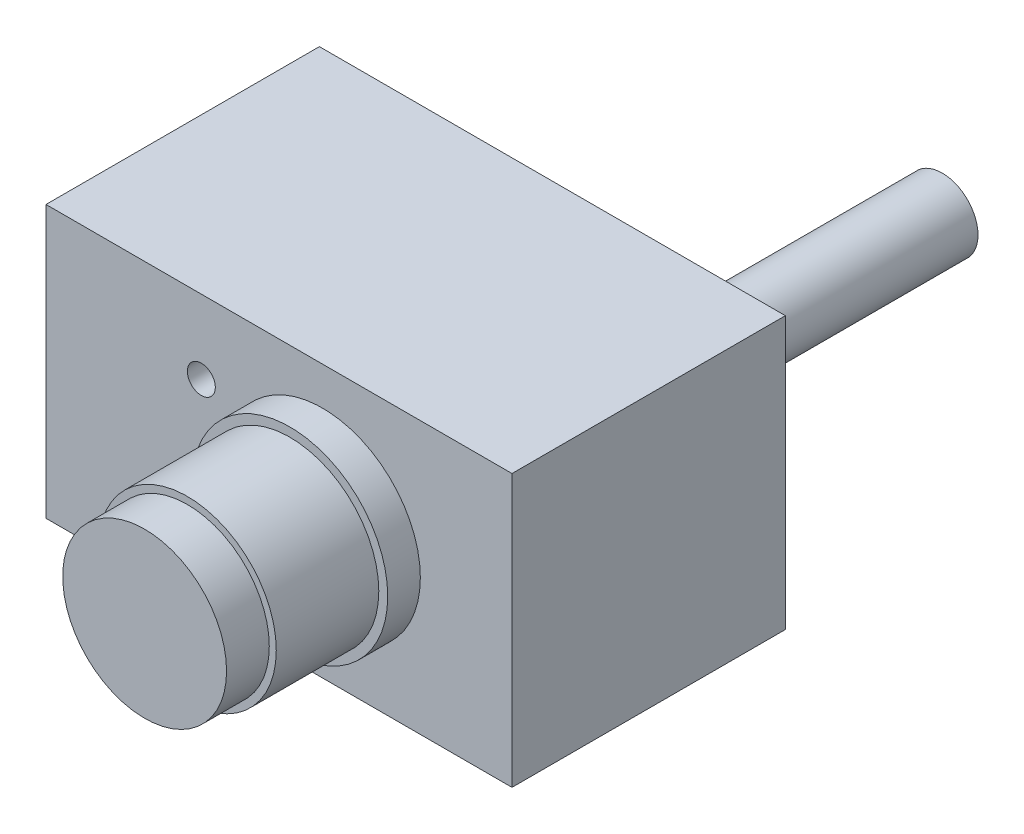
from build123d import *

# Parameters (mm, degrees)
SKETCH2_W           = 76.2
SKETCH2_H           = 44.704
BASE_EXTRUDE_DEPTH  = 44.45
SKETCH3_R           = 16.002
BOSS_EXTRUDE1_DEPTH = 5.334
SKETCH4_R           = 14.5415
BOSS_EXTRUDE2_DEPTH = 16.764
SKETCH6_R           = 13.3985
BOSS_EXTRUDE3_DEPTH = 6.985
BOSS_EXTRUDE4_DEPTH = 2.921
SKETCH15_R          = 6.35
EXTRUDE1_DEPTH      = 2.54
SKETCH16_R          = 5.842
EXTRUDE2_DEPTH      = 35.56
SKETCH17_R          = 2.286
CUT_EXTRUDE1_DEPTH  = 12.7


with BuildPart() as part:
    # Sketch2 → Base-Extrude (new body)
    with BuildSketch(Plane(origin=(0, 0, 0), x_dir=(1, 0, 0), z_dir=(0, 1, 0))):
        with Locations((38.1, 22.352)):
            Rectangle(SKETCH2_W, SKETCH2_H)
    extrude(amount=BASE_EXTRUDE_DEPTH)

    # Sketch3 → Boss-Extrude1 (add)
    with BuildSketch(Plane.XY):
        with Locations(Location((45.212, 22.225, 0), (0, 0, 180))):
            Circle(SKETCH3_R)
    extrude(amount=BOSS_EXTRUDE1_DEPTH)

    # Sketch4 → Boss-Extrude2 (add)
    with BuildSketch(Plane.XY.offset(5.334)):
        with Locations((45.212, 22.225)):
            Circle(SKETCH4_R)
    extrude(amount=BOSS_EXTRUDE2_DEPTH)

    # Sketch6 → Boss-Extrude3 (add)
    with BuildSketch(Plane.XY.offset(22.098)):
        with Locations((45.212, 22.225)):
            Circle(SKETCH6_R)
    extrude(amount=BOSS_EXTRUDE3_DEPTH)

    # Sketch7 → Boss-Extrude4 (add)
    with BuildSketch(Plane(origin=(0, 0, -44.704), x_dir=(-1, 0, 0), z_dir=(0, 0, -1))):
        with BuildLine():
            Line((-47.605308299, 27.2796), (-14.307144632, 27.2796))
            ThreePointArc((-14.307144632, 27.2796), (-11.966289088, 28.309601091), (-11.144226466, 30.731319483))
            Line((-11.144226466, 30.731319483), (-11.468669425, 34.439719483))
            ThreePointArc((-11.468669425, 34.439719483), (-12.486588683, 36.503855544), (-14.631587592, 37.338))
            Line((-14.631587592, 37.338), (-47.280865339, 37.338))
            ThreePointArc((-47.280865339, 37.338), (-49.425864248, 36.503855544), (-50.443783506, 34.439719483))
            Line((-50.443783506, 34.439719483), (-50.768226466, 30.731319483))
            ThreePointArc((-50.768226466, 30.731319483), (-49.946163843, 28.309601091), (-47.605308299, 27.2796))
        make_face()
    extrude(amount=BOSS_EXTRUDE4_DEPTH)

    # Sketch15 → Extrude1 (add)
    with BuildSketch(Plane(origin=(0, 0, -44.704), x_dir=(-1, 0, 0), z_dir=(0, 0, -1))):
        with Locations(Location((-66.294, 22.225, 0), (0, 0, 180))):
            Circle(SKETCH15_R)
    extrude(amount=EXTRUDE1_DEPTH)

    # Sketch16 → Extrude2 (add)
    with BuildSketch(Plane(origin=(0, 0, -44.704), x_dir=(-1, 0, 0), z_dir=(0, 0, -1))):
        with Locations(Location((-66.294, 36.068, 0), (0, 0, 180))):
            Circle(SKETCH16_R)
    extrude(amount=EXTRUDE2_DEPTH)

    # Sketch17 → Cut-Extrude1 (cut)
    with BuildSketch(Plane.XY):
        with Locations((25.4, 12.065)):
            Circle(SKETCH17_R)
        with Locations((25.4, 32.385)):
            Circle(SKETCH17_R)
    extrude(amount=-CUT_EXTRUDE1_DEPTH, mode=Mode.SUBTRACT)


solid = part.part
